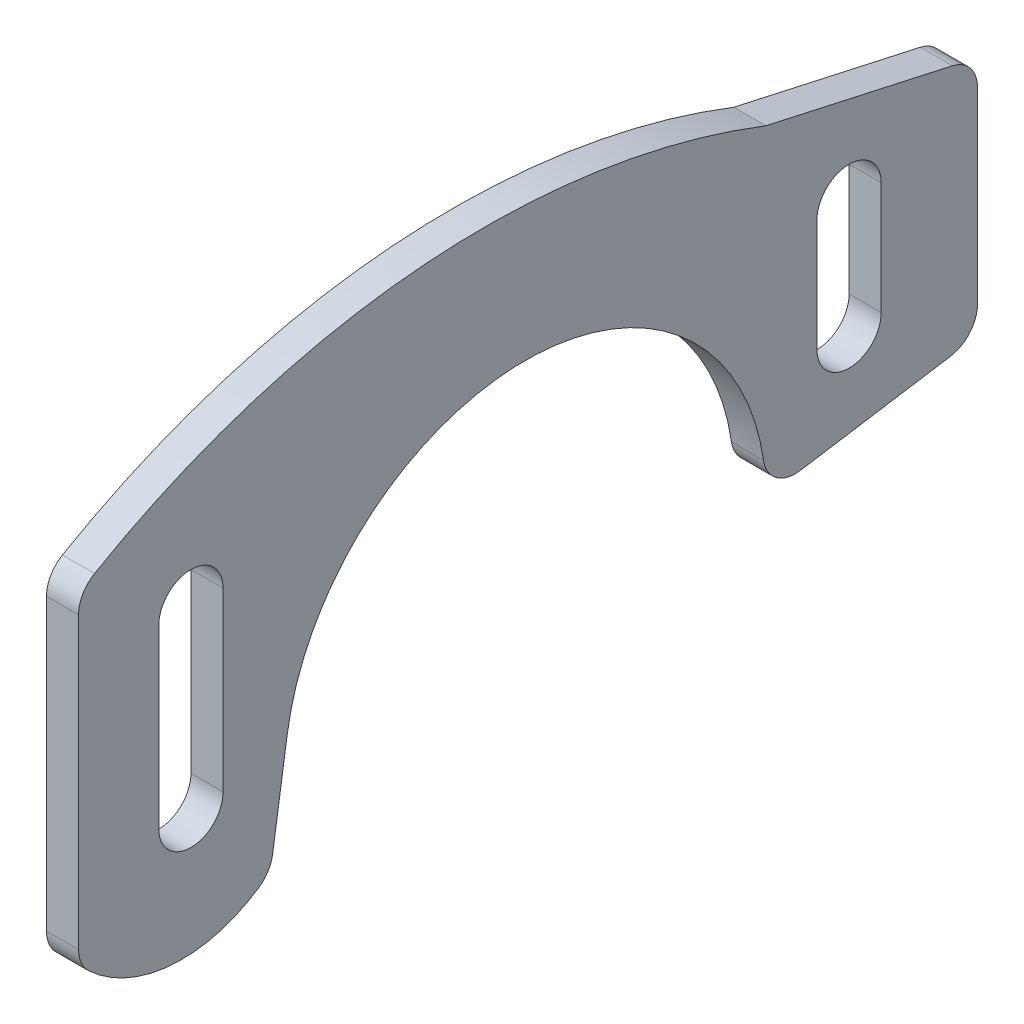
from build123d import *

# Parameters (mm, degrees)
RESSALTO_EXTRUS_O1_DEPTH = 2


with BuildPart() as part:
    # Esbo_o1 → Ressalto-extrus_o1 (new body)
    with BuildSketch(Plane(origin=(0, 0, 0), x_dir=(0, 0, -1), z_dir=(1, 0, 0))):
        with BuildLine():
            Line((0, -1.135256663), (0, -19.198580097))
            ThreePointArc((0, -19.198580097), (0.165672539, -19.99560128), (0.635242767, -20.66057794))
            ThreePointArc((0.635242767, -20.66057794), (5.79673997, -22.923055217), (11.239007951, -21.459642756))
            ThreePointArc((11.239007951, -21.459642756), (11.802930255, -20.872546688), (12.086175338, -20.109354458))
            Line((12.086175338, -20.109354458), (13, -14.080459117))
            ThreePointArc((13, -14.080459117), (27.8629628, -1.328429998), (42.670766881, -14.144468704))
            ThreePointArc((42.670766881, -14.144468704), (43.465031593, -15.464843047), (44.962324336, -15.8286552))
            Line((44.962324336, -15.8286552), (54.31286893, -14.347674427))
            ThreePointArc((54.31286893, -14.347674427), (55.520811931, -13.671193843), (56, -12.372297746))
            Line((56, -12.372297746), (56, -0.68631259))
            ThreePointArc((56, -0.68631259), (55.559508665, 0.565858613), (54.432067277, 1.266459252))
            Line((54.432067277, 1.266459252), (42.829728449, 3.833574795))
            ThreePointArc((42.829728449, 3.833574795), (21.542961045, 6.988627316), (0.995627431, 0.594262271))
            ThreePointArc((0.995627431, 0.594262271), (0.2666874, -0.137445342), (0, -1.135256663))
        make_face()
        with BuildLine():
            Line((9, -4.191253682), (9, -15.191253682))
            ThreePointArc((9, -15.191253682), (7, -17.191253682), (5, -15.191253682))
            Line((5, -15.191253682), (5, -4.191253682))
            ThreePointArc((5, -4.191253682), (7, -2.191253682), (9, -4.191253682))
        make_face(mode=Mode.SUBTRACT)
        with BuildLine():
            Line((50, -2.828963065), (50, -9.828963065))
            ThreePointArc((50, -9.828963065), (48, -11.828963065), (46, -9.828963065))
            Line((46, -9.828963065), (46, -2.828963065))
            ThreePointArc((46, -2.828963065), (48, -0.828963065), (50, -2.828963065))
        make_face(mode=Mode.SUBTRACT)
    extrude(amount=RESSALTO_EXTRUS_O1_DEPTH)


solid = part.part
